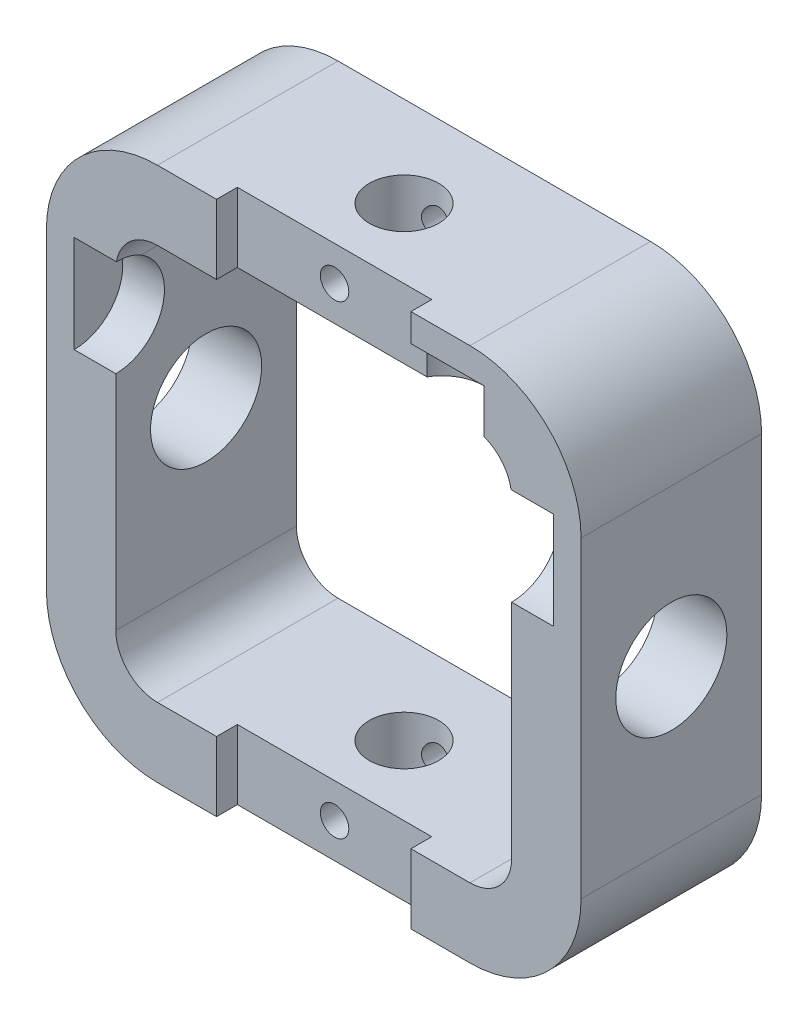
from build123d import *

# Parameters (mm, degrees)
EXTRUSION1_DEPTH                    = 13
ESQUISSE2_W                         = 14
ESQUISSE2_H                         = 42.234321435
ENL_V_MAT_EXTRU_1_DEPTH             = 1.5
TROU_TARAUD_M2_5X0_451_D            = 2.05
ESQUISSE5_R                         = 2.5
ENL_V_MAT_EXTRU_2_DEPTH             = 48.118017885
ESQUISSE6_R                         = 4
ENL_V_MAT_EXTRU_3_DEPTH             = 48.472744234
ENL_V_MAT_EXTRU_4_DEPTH             = 31.5
ENL_V_MAT_EXTRU_4_DEPTH_BACK        = 3
ESQUISSE7_R                         = 3.5
ESQUISSE8_R                         = 3
ENL_V_MAT_EXTRU_5_DEPTH             = 3
ENL_V_MAT_EXTRU_5_DIRECTION_2_REACH = 45.129


with BuildPart() as part:
    # Esquisse1 → Extrusion1 (new body)
    with BuildSketch(Plane.XY):
        with BuildLine():
            Line((-15.850736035, 24.544071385), (6.649263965, 24.544071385))
            ThreePointArc((6.649263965, 24.544071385), (12.306118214, 22.200925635), (14.649263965, 16.544071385))
            Line((14.649263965, 16.544071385), (14.649263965, -5.955928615))
            ThreePointArc((14.649263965, -5.955928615), (12.306118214, -11.612782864), (6.649263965, -13.955928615))
            Line((6.649263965, -13.955928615), (-15.850736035, -13.955928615))
            ThreePointArc((-15.850736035, -13.955928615), (-21.507590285, -11.612782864), (-23.850736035, -5.955928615))
            Line((-23.850736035, -5.955928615), (-23.850736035, 16.544071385))
            ThreePointArc((-23.850736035, 16.544071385), (-21.507590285, 22.200925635), (-15.850736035, 24.544071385))
        make_face()
        with BuildLine():
            Line((-15.850736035, 19.544071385), (6.649263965, 19.544071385))
            ThreePointArc((6.649263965, 19.544071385), (8.770584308, 18.665391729), (9.649263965, 16.544071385))
            Line((9.649263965, 16.544071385), (9.649263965, -5.955928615))
            ThreePointArc((9.649263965, -5.955928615), (8.770584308, -8.077248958), (6.649263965, -8.955928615))
            Line((6.649263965, -8.955928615), (-15.850736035, -8.955928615))
            ThreePointArc((-15.850736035, -8.955928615), (-17.972056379, -8.077248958), (-18.850736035, -5.955928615))
            Line((-18.850736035, -5.955928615), (-18.850736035, 16.544071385))
            ThreePointArc((-18.850736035, 16.544071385), (-17.972056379, 18.665391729), (-15.850736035, 19.544071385))
        make_face(mode=Mode.SUBTRACT)
    extrude(amount=EXTRUSION1_DEPTH)

    # Esquisse2 → Enl_v. mat.-Extru.1 (cut)
    with BuildSketch(Plane.XY.offset(13)):
        with Locations((-4.600736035, 5.332889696)):
            Rectangle(ESQUISSE2_W, ESQUISSE2_H)
    extrude(amount=-ENL_V_MAT_EXTRU_1_DEPTH, mode=Mode.SUBTRACT)

    # Trou taraud_ M2.5x0.451 (through all)
    with Locations(Plane.XY.offset(11.5)):
        with Locations((-4.600736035, 22.044071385), (-4.600736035, -11.455928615)):
            Hole(TROU_TARAUD_M2_5X0_451_D / 2)

    # Esquisse5 → Enl_v. mat.-Extru.2 (cut, through all)
    with BuildSketch(Plane(origin=(0, 24.544071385, 0), x_dir=(-1, 0, 0), z_dir=(0, 1, 0))):
        with Locations(Location((4.600736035, 6.5, 0), (0, 0, 90))):
            Circle(ESQUISSE5_R)
    extrude(amount=-ENL_V_MAT_EXTRU_2_DEPTH, mode=Mode.SUBTRACT)

    # Esquisse6 → Enl_v. mat.-Extru.3 (cut, through all)
    with BuildSketch(Plane(origin=(14.649263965, 0, 0), x_dir=(0, 0, -1), z_dir=(1, 0, 0))):
        with Locations(Location((-6.5, 5.294071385, 0), (0, 0, 90))):
            Circle(ESQUISSE6_R)
    extrude(amount=-ENL_V_MAT_EXTRU_3_DEPTH, mode=Mode.SUBTRACT)

    # Esquisse7 → Enl_v. mat.-Extru.4 (cut, two sides: drawn at the far end of the back side and taken through both)
    with BuildSketch(Plane(origin=(-18.850736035, 0, 0), x_dir=(0, 0, -1), z_dir=(1, 0, 0)).offset(-ENL_V_MAT_EXTRU_4_DEPTH_BACK)):
        with Locations((-13, 13.544071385)):
            Circle(ESQUISSE7_R)
    extrude(amount=ENL_V_MAT_EXTRU_4_DEPTH + ENL_V_MAT_EXTRU_4_DEPTH_BACK, mode=Mode.SUBTRACT)

    # Esquisse8 → Enl_v. mat.-Extru.5 (cut)
    with BuildSketch(Plane.XZ.offset(-19.544071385)):
        with Locations((4.649263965, 13)):
            Circle(ESQUISSE8_R)
    extrude(amount=-ENL_V_MAT_EXTRU_5_DEPTH, mode=Mode.SUBTRACT)

    # Esquisse8 → Enl_v. mat.-Extru.5 direction 2 (cut, up to next)
    with BuildSketch(Plane.XZ.offset(-19.544071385), mode=Mode.PRIVATE) as enl_v_mat_extru_5_direction_2_sk1:
        with Locations((4.649263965, 13)):
            Circle(ESQUISSE8_R)
    enl_v_mat_extru_5_direction_2_tool1 = extrude(enl_v_mat_extru_5_direction_2_sk1.sketch, amount=ENL_V_MAT_EXTRU_5_DIRECTION_2_REACH, mode=Mode.PRIVATE) & part.part
    add(enl_v_mat_extru_5_direction_2_tool1.solids().sort_by_distance((4.649264, 19.544071, 13))[0], mode=Mode.SUBTRACT)


solid = part.part
